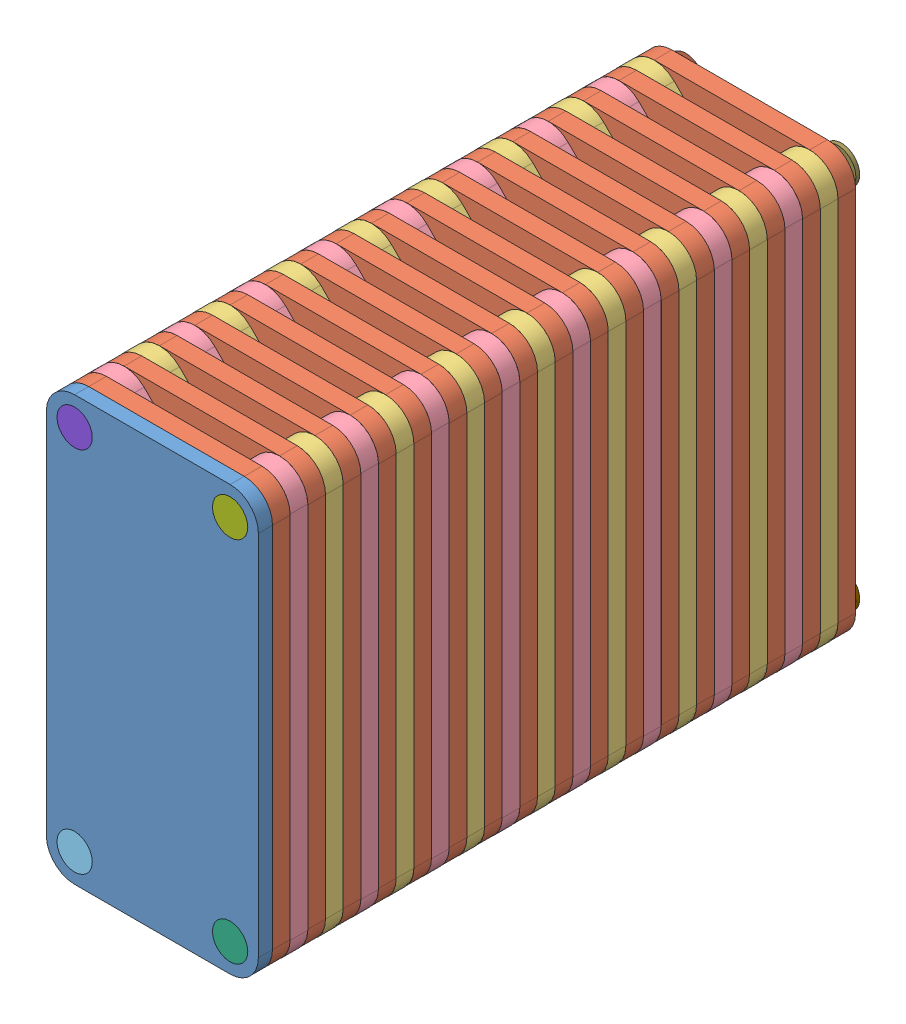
SolidWorks assembly Montage TEST V2.SLDASM, configuration Défaut (file format 14000). Lengths in mm.
Overall size (600 1200 1730.01).
43 component instances, 12 part files, 12 mates.
Components (placement in the parent):
- Plaque fermeture AVANT-1: Plaque fermeture AVANT.SLDPRT [Défaut] at (-409.2181 326.8663 -897.6403) size (600 1200 40)
- plaque intermédiaire-1: plaque intermédiaire.SLDPRT [Défaut] at (-409.2181 326.8663 -947.6403) size (600 1200 50)
- plaque support B-1: plaque support B.SLDPRT [Défaut] at (-1009.1525 326.8663 -1097.6403) size (599.97 1200 50)
- plaque support A-2: plaque support A.SLDPRT [Défaut] at (-409.2181 326.8663 -997.6403) size (599.97 1200 50)
- plaque intermédiaire-2: plaque intermédiaire.SLDPRT [Défaut] at (-409.2181 326.8663 -1047.6403) size (600 1200 50)
- plaque intermédiaire-3: plaque intermédiaire.SLDPRT [Défaut] at (-409.2181 326.8663 -1147.6403) size (600 1200 50)
- plaque support A-3: plaque support A.SLDPRT [Défaut] at (-409.2181 326.8663 -1197.6403) size (599.97 1200 50)
- plaque support A-4: plaque support A.SLDPRT [Défaut] at (-409.2181 326.8663 -1397.6403) size (599.97 1200 50)
- plaque support A-5: plaque support A.SLDPRT [Défaut] at (-409.2181 326.8663 -1597.6403) size (599.97 1200 50)
- plaque support A-6: plaque support A.SLDPRT [Défaut] at (-409.2181 326.8663 -1797.6403) size (599.97 1200 50)
- plaque support A-7: plaque support A.SLDPRT [Défaut] at (-409.2181 326.8663 -1997.6403) size (599.97 1200 50)
- plaque support A-8: plaque support A.SLDPRT [Défaut] at (-409.2181 326.8663 -2197.6403) size (599.97 1200 50)
- plaque support A-9: plaque support A.SLDPRT [Défaut] at (-409.2181 326.8663 -2397.6403) size (599.97 1200 50)
- plaque intermédiaire-4: plaque intermédiaire.SLDPRT [Défaut] at (-409.2181 326.8663 -1247.6403) size (600 1200 50)
- plaque intermédiaire-5: plaque intermédiaire.SLDPRT [Défaut] at (-409.2181 326.8663 -1447.6403) size (600 1200 50)
- plaque intermédiaire-6: plaque intermédiaire.SLDPRT [Défaut] at (-409.2181 326.8663 -1647.6403) size (600 1200 50)
- plaque intermédiaire-7: plaque intermédiaire.SLDPRT [Défaut] at (-409.2181 326.8663 -1847.6403) size (600 1200 50)
- plaque intermédiaire-8: plaque intermédiaire.SLDPRT [Défaut] at (-409.2181 326.8663 -2047.6403) size (600 1200 50)
- plaque intermédiaire-9: plaque intermédiaire.SLDPRT [Défaut] at (-409.2181 326.8663 -2247.6403) size (600 1200 50)
- plaque intermédiaire-10: plaque intermédiaire.SLDPRT [Défaut] at (-409.2181 326.8663 -2447.6403) size (600 1200 50)
- plaque support B-2: plaque support B.SLDPRT [Défaut] at (-1009.1525 326.8663 -1297.6403) size (599.97 1200 50)
- plaque support B-3: plaque support B.SLDPRT [Défaut] at (-1009.1525 326.8663 -1497.6403) size (599.97 1200 50)
- plaque support B-4: plaque support B.SLDPRT [Défaut] at (-1009.1525 326.8663 -1697.6403) size (599.97 1200 50)
- plaque support B-5: plaque support B.SLDPRT [Défaut] at (-1009.1525 326.8663 -1897.6403) size (599.97 1200 50)
- plaque support B-6: plaque support B.SLDPRT [Défaut] at (-1009.1525 326.8663 -2097.6403) size (599.97 1200 50)
- plaque support B-7: plaque support B.SLDPRT [Défaut] at (-1009.1525 326.8663 -2297.6403) size (599.97 1200 50)
- plaque support B-8: plaque support B.SLDPRT [Défaut] at (-1009.1525 326.8663 -2497.6403) size (599.97 1200 50)
- plaque intermédiaire-11: plaque intermédiaire.SLDPRT [Défaut] at (-409.2181 326.8663 -1347.6403) size (600 1200 50)
- plaque intermédiaire-12: plaque intermédiaire.SLDPRT [Défaut] at (-409.2181 326.8663 -1547.6403) size (600 1200 50)
- plaque intermédiaire-13: plaque intermédiaire.SLDPRT [Défaut] at (-409.2181 326.8663 -1747.6403) size (600 1200 50)
- plaque intermédiaire-14: plaque intermédiaire.SLDPRT [Défaut] at (-409.2181 326.8663 -1947.6403) size (600 1200 50)
- plaque intermédiaire-15: plaque intermédiaire.SLDPRT [Défaut] at (-409.2181 326.8663 -2147.6403) size (600 1200 50)
- plaque intermédiaire-16: plaque intermédiaire.SLDPRT [Défaut] at (-409.2181 326.8663 -2347.6403) size (600 1200 50)
- plaque intermédiaire-17: plaque intermédiaire.SLDPRT [Défaut] at (-409.2181 326.8663 -2547.6403) size (600 1200 50)
- Plaque fermeture AVANT-2: Plaque fermeture AVANT.SLDPRT [Défaut] at (-409.2181 326.8663 -2547.6403) x (-1 0 0) z (0 0 -1) size (600 1200 40) (hidden)
- BOUCHON9-1: BOUCHON9.SLDPRT [Défaut] at origin size (102.84 102.84 10.96)
- BOUCHON10-1: BOUCHON10.SLDPRT [Défaut] at origin size (102.84 102.84 10.96)
- BOUCHON11-1: BOUCHON11.SLDPRT [Défaut] at origin size (102.84 102.84 10.96)
- BOUCHON12-1: BOUCHON12.SLDPRT [Défaut] at origin size (102.84 102.84 10.96)
- BOUCHON13-1: BOUCHON13.SLDPRT [Défaut] at origin size (102.84 102.84 10.96)
- BOUCHON14-1: BOUCHON14.SLDPRT [Défaut] at origin size (102.84 102.84 10.96)
- BOUCHON15-1: BOUCHON15.SLDPRT [Défaut] at origin size (102.84 102.84 10.96)
- BOUCHON16-1: BOUCHON16.SLDPRT [Défaut] at origin size (102.84 102.84 10.96)
Mates (geometry in assembly coordinates):
- Coaxiale1: concentric aligned: cylinder of plaque intermédiaire-1 through (-189.2181 846.8663 -897.6403) axis (0 0 -1) radius 50; cylinder of plaque support A-2 through (-189.2181 846.8663 -947.6403) axis (0 0 -1) radius 50
- Coïncidente1: coincident anti-aligned: plane of plaque support A-2 through (-409.2181 326.8663 -997.6403) normal (0 0 -1); plane of plaque intermédiaire-2 through (-629.2181 -193.1337 -997.6403) normal (0 0 1)
- Coaxiale2: concentric anti-aligned: circle of plaque support A-2; cylinder of plaque intermédiaire-2 through (-189.2181 846.8663 -997.6403) axis (0 0 -1) radius 50
- Coïncidente2: coincident anti-aligned: plane of plaque support B-1 through (-1009.1525 326.8663 -1047.6403) normal (0 0 1); plane of plaque intermédiaire-2 through (-629.2181 -193.1337 -1047.6403) normal (0 0 -1)
- Coaxiale3: concentric anti-aligned: circle of plaque support B-1; circle of plaque support A-2
- Coïncidente3: coincident anti-aligned: plane of plaque support B-1 through (-1009.1525 326.8663 -1097.6403) normal (0 0 -1); plane of plaque intermédiaire-3 through (-629.2181 -193.1337 -1097.6403) normal (0 0 1)
- Coaxiale4: concentric aligned: circle of plaque support B-1; cylinder of plaque intermédiaire-3 through (-629.2181 846.8663 -1097.6403) axis (0 0 -1) radius 50
- Coïncidente4: coincident anti-aligned: plane of plaque intermédiaire-17 through (-629.2181 -193.1337 -2547.6403) normal (0 0 -1); plane of Plaque fermeture AVANT-2 through (-189.2181 -193.1337 -2547.6403) normal (0 0 1)
- Coaxiale5: concentric anti-aligned: circle of plaque intermédiaire-17; circle of Plaque fermeture AVANT-2
- Coaxiale6: concentric anti-aligned: circle of plaque intermédiaire-17; circle of Plaque fermeture AVANT-2
- Coïncidente6: coincident anti-aligned: plane of Plaque fermeture AVANT-1 through (-629.2181 -193.1337 -897.6403) normal (0 0 -1); plane of plaque intermédiaire-1 through (-629.2181 -193.1337 -897.6403) normal (0 0 1)
- Coaxiale7: concentric aligned: circle of Plaque fermeture AVANT-1; circle of plaque intermédiaire-1
